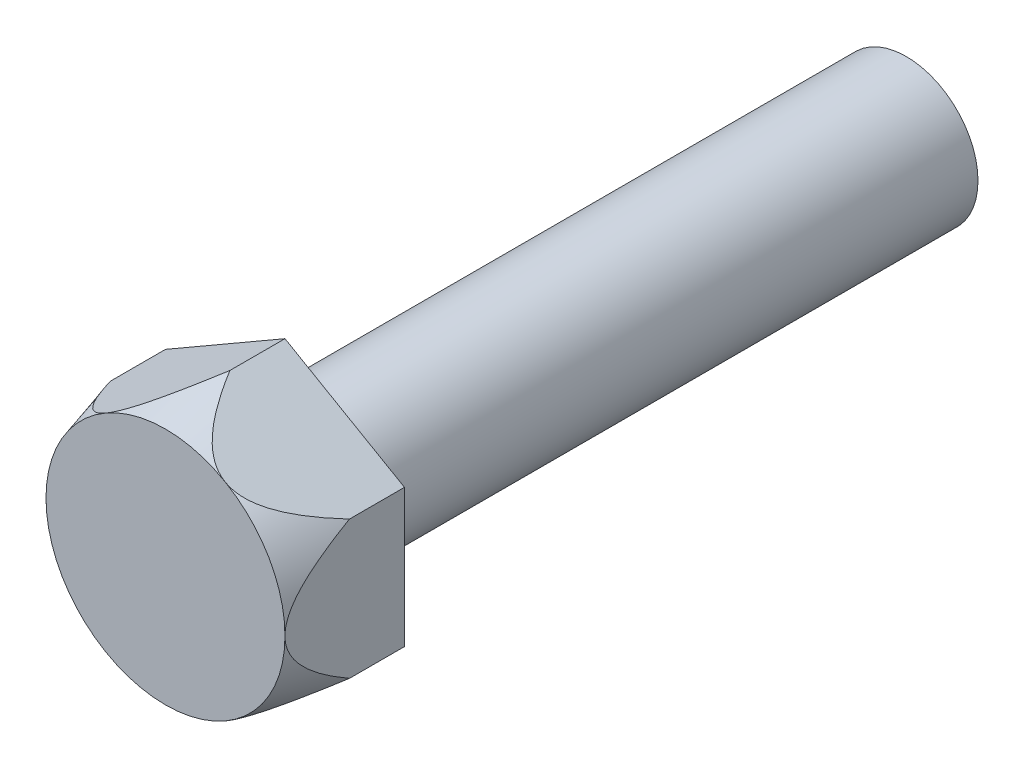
from build123d import *

# Parameters (mm, degrees)
BOSS_EXTRUDE1_DEPTH = 2.5
SKETCH2_OUTSIDE_W   = 10.042
SKETCH2_OUTSIDE_H   = 10.816
SKETCH2_OUTSIDE_R   = 2.5
CUT_EXTRUDE1_DEPTH  = 2.5
CUT_EXTRUDE1_DRAFT  = -16
SKETCH3_R           = 1.5
BOSS_EXTRUDE2_DEPTH = 13


with BuildPart() as part:
    # Sketch1 → Boss-Extrude1 (new body)
    with BuildSketch(Plane.XY):
        Polygon((0, 2.886751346), (-2.5, 1.443375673), (-2.5, -1.443375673), (0, -2.886751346), (2.5, -1.443375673), (2.5, 1.443375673), align=None)
    extrude(amount=BOSS_EXTRUDE1_DEPTH)


with BuildPart() as cut_extrude1_tool:
    # Sketch2 outside → Cut-Extrude1 (with draft: the straight prism first)
    with BuildSketch(Plane.XY.offset(2.5)):
        Rectangle(SKETCH2_OUTSIDE_W, SKETCH2_OUTSIDE_H)
        Circle(SKETCH2_OUTSIDE_R, mode=Mode.SUBTRACT)
    extrude(amount=-CUT_EXTRUDE1_DEPTH)
    # Cut-Extrude1: the draft: its side faces are tilted about the plane it starts from
    cut_extrude1_sides = [cut_extrude1_tool.faces().sort_by_distance(p)[0] for p in [
        (0, -5.408, 1.25),
        (5.021, 0, 1.25),
        (0, 5.408, 1.25),
        (-5.021, 0, 1.25),
        (-2.5, 0, 1.25),
    ]]
    draft(cut_extrude1_sides, Plane.XY.offset(2.5), CUT_EXTRUDE1_DRAFT)


with BuildPart() as part_1:
    add(part.part)

    # Cut-Extrude1: cut by cut_extrude1_tool
    add(cut_extrude1_tool.part, mode=Mode.SUBTRACT)

    # Sketch3 → Boss-Extrude2 (add)
    with BuildSketch(Plane(origin=(0, 0, 0), x_dir=(-1, 0, 0), z_dir=(0, 0, -1))):
        with Locations(Location((0, 0, 0), (0, 0, 180))):
            Circle(SKETCH3_R)
    extrude(amount=BOSS_EXTRUDE2_DEPTH)


solid = part_1.part
